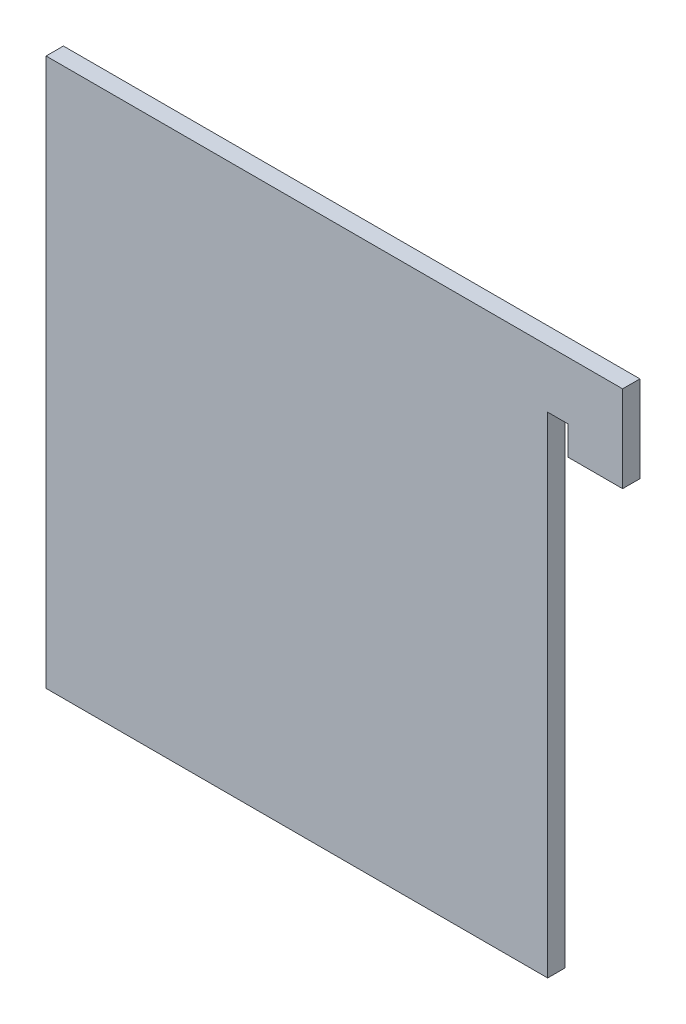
from build123d import *

# Parameters (mm, degrees)
ESQUISSE1_W             = 100
ESQUISSE1_H             = 95
EXTRUSION1_DEPTH        = 3
ESQUISSE2_W             = 13
ESQUISSE2_H             = 80
ENL_V_MAT_EXTRU_1_DEPTH = 3
ESQUISSE4_W             = 3.5
ESQUISSE4_H             = 5
ENL_V_MAT_EXTRU_3_DEPTH = 3


with BuildPart() as part:
    # Esquisse1 → Extrusion1 (new body)
    with BuildSketch(Plane.XY):
        with Locations((50, 47.5)):
            Rectangle(ESQUISSE1_W, ESQUISSE1_H)
    extrude(amount=EXTRUSION1_DEPTH)

    # Esquisse2 → Enl_v. mat.-Extru.1 (cut)
    with BuildSketch(Plane.XY.offset(3)):
        with Locations((93.5, 40)):
            Rectangle(ESQUISSE2_W, ESQUISSE2_H)
    extrude(amount=-ENL_V_MAT_EXTRU_1_DEPTH, mode=Mode.SUBTRACT)

    # Esquisse4 → Enl_v. mat.-Extru.3 (cut)
    with BuildSketch(Plane.XY.offset(3)):
        with Locations((88.75, 82.5)):
            Rectangle(ESQUISSE4_W, ESQUISSE4_H)
    extrude(amount=-ENL_V_MAT_EXTRU_3_DEPTH, mode=Mode.SUBTRACT)


solid = part.part
